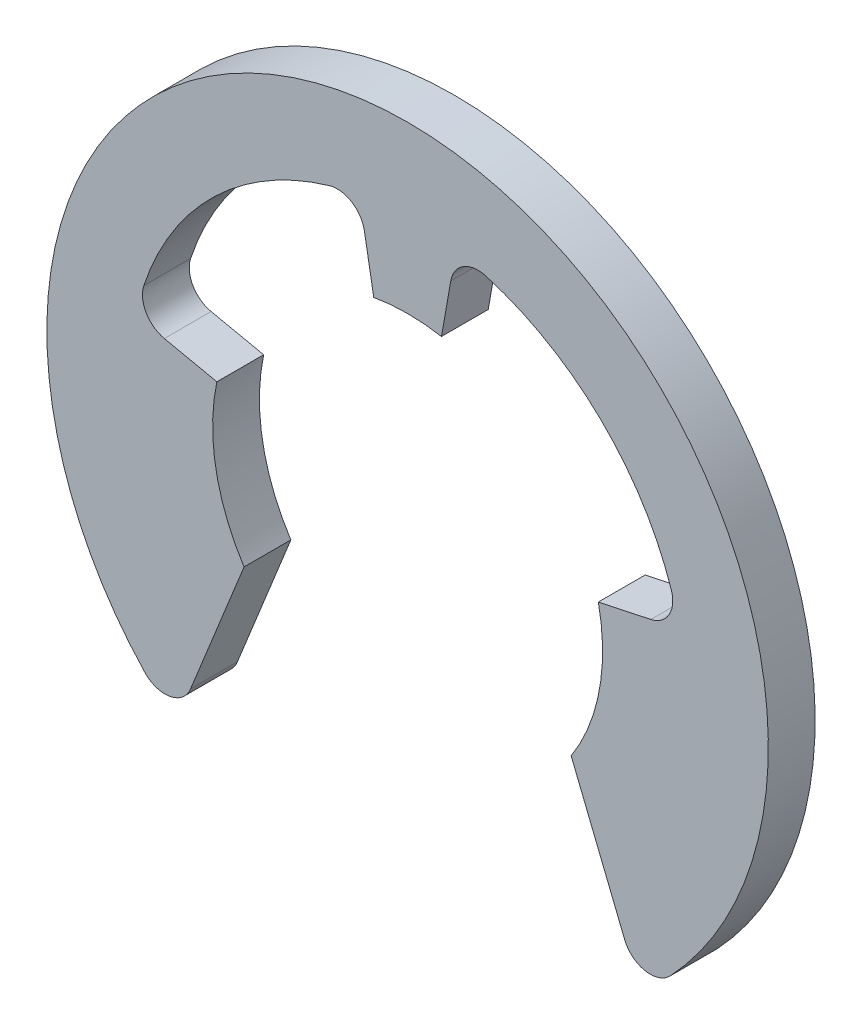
ISO-10303-21;
HEADER;
FILE_DESCRIPTION(('STEP AP214'),'2;1');
FILE_NAME('part.step','',(''),(''),'','','');
FILE_SCHEMA(('AUTOMOTIVE_DESIGN { 1 0 10303 214 1 1 1 1 }'));
ENDSEC;
DATA;
#1=APPLICATION_CONTEXT('core data for automotive mechanical design processes');
#2=APPLICATION_PROTOCOL_DEFINITION('international standard','automotive_design',2000,#1);
#3=PRODUCT_CONTEXT('',#1,'mechanical');
#4=PRODUCT('Part','Part','',(#3));
#5=PRODUCT_RELATED_PRODUCT_CATEGORY('part','',(#4));
#6=PRODUCT_DEFINITION_FORMATION('','',#4);
#7=PRODUCT_DEFINITION_CONTEXT('part definition',#1,'design');
#8=PRODUCT_DEFINITION('design','',#6,#7);
#9=PRODUCT_DEFINITION_SHAPE('','',#8);
#10=(LENGTH_UNIT() NAMED_UNIT(*) SI_UNIT(.MILLI.,.METRE.));
#11=(NAMED_UNIT(*) PLANE_ANGLE_UNIT() SI_UNIT($,.RADIAN.));
#12=(NAMED_UNIT(*) SI_UNIT($,.STERADIAN.) SOLID_ANGLE_UNIT());
#13=UNCERTAINTY_MEASURE_WITH_UNIT(LENGTH_MEASURE(1.E-05),#10,'distance_accuracy_value','');
#14=(GEOMETRIC_REPRESENTATION_CONTEXT(3) GLOBAL_UNCERTAINTY_ASSIGNED_CONTEXT((#13)) GLOBAL_UNIT_ASSIGNED_CONTEXT((#10,
#11,#12)) REPRESENTATION_CONTEXT('',''));
#15=CARTESIAN_POINT('',(0.,0.,0.));
#16=DIRECTION('',(0.,0.,1.));
#17=DIRECTION('',(1.,0.,0.));
#18=AXIS2_PLACEMENT_3D('',#15,#16,#17);
#19=CARTESIAN_POINT('',(-1.94289029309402E-13,0.,1.2));
#20=DIRECTION('',(0.,0.,-1.));
#21=DIRECTION('',(-1.,0.,0.));
#22=AXIS2_PLACEMENT_3D('',#19,#20,#21);
#23=CYLINDRICAL_SURFACE('',#22,9.25);
#24=CARTESIAN_POINT('',(0.,0.,0.));
#25=DIRECTION('',(0.,0.,1.));
#26=DIRECTION('',(1.,0.,0.));
#27=AXIS2_PLACEMENT_3D('',#24,#25,#26);
#28=CIRCLE('',#27,9.25);
#29=CARTESIAN_POINT('',(6.73756513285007,-6.33780057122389,0.));
#30=VERTEX_POINT('',#29);
#31=CARTESIAN_POINT('',(-6.73756513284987,-6.33780057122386,0.));
#32=VERTEX_POINT('',#31);
#33=EDGE_CURVE('E162',#30,#32,#28,.T.);
#34=ORIENTED_EDGE('',*,*,#33,.T.);
#35=DIRECTION('',(0.,0.,-1.));
#36=VECTOR('',#35,1.);
#37=CARTESIAN_POINT('',(-6.73756513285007,-6.33780057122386,1.2));
#38=LINE('',#37,#36);
#39=CARTESIAN_POINT('',(-6.73756513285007,-6.33780057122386,1.2));
#40=VERTEX_POINT('',#39);
#41=EDGE_CURVE('E11',#40,#32,#38,.T.);
#42=ORIENTED_EDGE('',*,*,#41,.F.);
#43=CARTESIAN_POINT('',(-1.94289029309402E-13,0.,1.2));
#44=DIRECTION('',(0.,0.,1.));
#45=DIRECTION('',(1.,0.,0.));
#46=AXIS2_PLACEMENT_3D('',#43,#44,#45);
#47=CIRCLE('',#46,9.25);
#48=CARTESIAN_POINT('',(6.73756513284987,-6.33780057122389,1.2));
#49=VERTEX_POINT('',#48);
#50=EDGE_CURVE('E163',#49,#40,#47,.T.);
#51=ORIENTED_EDGE('',*,*,#50,.F.);
#52=DIRECTION('',(0.,0.,-1.));
#53=VECTOR('',#52,1.);
#54=CARTESIAN_POINT('',(6.73756513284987,-6.33780057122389,1.2));
#55=LINE('',#54,#53);
#56=EDGE_CURVE('E158',#49,#30,#55,.T.);
#57=ORIENTED_EDGE('',*,*,#56,.T.);
#58=EDGE_LOOP('',(#34,#42,#51,#57));
#59=FACE_BOUND('',#58,.T.);
#60=ADVANCED_FACE('F16',(#59),#23,.T.);
#61=CARTESIAN_POINT('',(-6.22162546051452,-5.85247350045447,1.2));
#62=DIRECTION('',(0.,0.,-1.));
#63=DIRECTION('',(-1.,0.,0.));
#64=AXIS2_PLACEMENT_3D('',#61,#62,#63);
#65=CYLINDRICAL_SURFACE('',#64,0.708333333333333);
#66=CARTESIAN_POINT('',(-6.22162546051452,-5.85247350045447,0.));
#67=DIRECTION('',(0.,0.,1.));
#68=DIRECTION('',(1.,0.,0.));
#69=AXIS2_PLACEMENT_3D('',#66,#67,#68);
#70=CIRCLE('',#69,0.708333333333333);
#71=CARTESIAN_POINT('',(-5.5648702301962,-6.11781983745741,0.));
#72=VERTEX_POINT('',#71);
#73=EDGE_CURVE('E207',#32,#72,#70,.T.);
#74=ORIENTED_EDGE('',*,*,#73,.T.);
#75=DIRECTION('',(0.,0.,-1.));
#76=VECTOR('',#75,1.);
#77=CARTESIAN_POINT('',(-5.56487023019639,-6.11781983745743,1.2));
#78=LINE('',#77,#76);
#79=CARTESIAN_POINT('',(-5.56487023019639,-6.11781983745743,1.2));
#80=VERTEX_POINT('',#79);
#81=EDGE_CURVE('E24',#80,#72,#78,.T.);
#82=ORIENTED_EDGE('',*,*,#81,.F.);
#83=CARTESIAN_POINT('',(-6.22162546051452,-5.85247350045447,1.2));
#84=DIRECTION('',(0.,0.,1.));
#85=DIRECTION('',(1.,0.,0.));
#86=AXIS2_PLACEMENT_3D('',#83,#84,#85);
#87=CIRCLE('',#86,0.708333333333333);
#88=EDGE_CURVE('E31',#40,#80,#87,.T.);
#89=ORIENTED_EDGE('',*,*,#88,.F.);
#90=ORIENTED_EDGE('',*,*,#41,.T.);
#91=EDGE_LOOP('',(#74,#82,#89,#90));
#92=FACE_BOUND('',#91,.T.);
#93=ADVANCED_FACE('F342',(#92),#65,.T.);
#94=CARTESIAN_POINT('',(-4.19335283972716,-2.72319517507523,1.19999999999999));
#95=DIRECTION('',(0.927183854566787,-0.374606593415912,0.));
#96=DIRECTION('',(0.374606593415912,0.927183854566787,0.));
#97=AXIS2_PLACEMENT_3D('',#94,#95,#96);
#98=PLANE('',#97);
#99=DIRECTION('',(-0.374606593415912,-0.927183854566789,0.));
#100=VECTOR('',#99,1.);
#101=CARTESIAN_POINT('',(-4.19335283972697,-2.7231951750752,0.));
#102=LINE('',#101,#100);
#103=CARTESIAN_POINT('',(-4.19335283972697,-2.7231951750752,0.));
#104=VERTEX_POINT('',#103);
#105=EDGE_CURVE('E204',#104,#72,#102,.T.);
#106=ORIENTED_EDGE('',*,*,#105,.F.);
#107=DIRECTION('',(0.,0.,-1.));
#108=VECTOR('',#107,1.);
#109=CARTESIAN_POINT('',(-4.19335283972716,-2.72319517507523,1.19999999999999));
#110=LINE('',#109,#108);
#111=CARTESIAN_POINT('',(-4.19335283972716,-2.72319517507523,1.19999999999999));
#112=VERTEX_POINT('',#111);
#113=EDGE_CURVE('E256',#112,#104,#110,.T.);
#114=ORIENTED_EDGE('',*,*,#113,.F.);
#115=DIRECTION('',(-0.374606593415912,-0.927183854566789,0.));
#116=VECTOR('',#115,1.);
#117=CARTESIAN_POINT('',(-4.19335283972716,-2.72319517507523,1.19999999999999));
#118=LINE('',#117,#116);
#119=EDGE_CURVE('E251',#112,#80,#118,.T.);
#120=ORIENTED_EDGE('',*,*,#119,.T.);
#121=ORIENTED_EDGE('',*,*,#81,.T.);
#122=EDGE_LOOP('',(#106,#114,#120,#121));
#123=FACE_BOUND('',#122,.T.);
#124=ADVANCED_FACE('F341',(#123),#98,.T.);
#125=CARTESIAN_POINT('',(-1.94289029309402E-13,0.,1.2));
#126=DIRECTION('',(0.,0.,-1.));
#127=DIRECTION('',(-1.,0.,0.));
#128=AXIS2_PLACEMENT_3D('',#125,#126,#127);
#129=CYLINDRICAL_SURFACE('',#128,5.);
#130=CARTESIAN_POINT('',(0.,0.,0.));
#131=DIRECTION('',(0.,0.,1.));
#132=DIRECTION('',(1.,0.,0.));
#133=AXIS2_PLACEMENT_3D('',#130,#131,#132);
#134=CIRCLE('',#133,5.);
#135=CARTESIAN_POINT('',(-4.89073800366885,1.03955845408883,0.));
#136=VERTEX_POINT('',#135);
#137=EDGE_CURVE('E201',#136,#104,#134,.T.);
#138=ORIENTED_EDGE('',*,*,#137,.F.);
#139=DIRECTION('',(0.,0.,-1.));
#140=VECTOR('',#139,1.);
#141=CARTESIAN_POINT('',(-4.89073800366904,1.03955845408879,1.2));
#142=LINE('',#141,#140);
#143=CARTESIAN_POINT('',(-4.89073800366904,1.03955845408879,1.2));
#144=VERTEX_POINT('',#143);
#145=EDGE_CURVE('E258',#144,#136,#142,.T.);
#146=ORIENTED_EDGE('',*,*,#145,.F.);
#147=CARTESIAN_POINT('',(-1.94289029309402E-13,0.,1.2));
#148=DIRECTION('',(0.,0.,1.));
#149=DIRECTION('',(1.,0.,0.));
#150=AXIS2_PLACEMENT_3D('',#147,#148,#149);
#151=CIRCLE('',#150,5.);
#152=EDGE_CURVE('E248',#144,#112,#151,.T.);
#153=ORIENTED_EDGE('',*,*,#152,.T.);
#154=ORIENTED_EDGE('',*,*,#113,.T.);
#155=EDGE_LOOP('',(#138,#146,#153,#154));
#156=FACE_BOUND('',#155,.T.);
#157=ADVANCED_FACE('F338',(#156),#129,.F.);
#158=CARTESIAN_POINT('',(-4.89073800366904,1.03955845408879,1.2));
#159=DIRECTION('',(-0.207911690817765,-0.978147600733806,0.));
#160=DIRECTION('',(0.978147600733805,-0.207911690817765,0.));
#161=AXIS2_PLACEMENT_3D('',#158,#159,#160);
#162=PLANE('',#161);
#163=DIRECTION('',(-0.978147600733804,0.207911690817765,0.));
#164=VECTOR('',#163,1.);
#165=CARTESIAN_POINT('',(-4.89073800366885,1.03955845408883,0.));
#166=LINE('',#165,#164);
#167=CARTESIAN_POINT('',(-6.23808791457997,1.32594651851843,0.));
#168=VERTEX_POINT('',#167);
#169=EDGE_CURVE('E198',#136,#168,#166,.T.);
#170=ORIENTED_EDGE('',*,*,#169,.T.);
#171=DIRECTION('',(0.,0.,-1.));
#172=VECTOR('',#171,1.);
#173=CARTESIAN_POINT('',(-6.23808791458,1.32594651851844,1.2));
#174=LINE('',#173,#172);
#175=CARTESIAN_POINT('',(-6.23808791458,1.32594651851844,1.2));
#176=VERTEX_POINT('',#175);
#177=EDGE_CURVE('E260',#176,#168,#174,.T.);
#178=ORIENTED_EDGE('',*,*,#177,.F.);
#179=DIRECTION('',(-0.978147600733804,0.207911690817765,0.));
#180=VECTOR('',#179,1.);
#181=CARTESIAN_POINT('',(-4.89073800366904,1.03955845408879,1.2));
#182=LINE('',#181,#180);
#183=EDGE_CURVE('E246',#144,#176,#182,.T.);
#184=ORIENTED_EDGE('',*,*,#183,.F.);
#185=ORIENTED_EDGE('',*,*,#145,.T.);
#186=EDGE_LOOP('',(#170,#178,#184,#185));
#187=FACE_BOUND('',#186,.T.);
#188=ADVANCED_FACE('F335',(#187),#162,.F.);
#189=CARTESIAN_POINT('',(-6.09081713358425,2.0188010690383,1.2));
#190=DIRECTION('',(0.,0.,-1.));
#191=DIRECTION('',(-1.,0.,0.));
#192=AXIS2_PLACEMENT_3D('',#189,#190,#191);
#193=CYLINDRICAL_SURFACE('',#192,0.708333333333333);
#194=CARTESIAN_POINT('',(-6.09081713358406,2.01880106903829,0.));
#195=DIRECTION('',(0.,0.,1.));
#196=DIRECTION('',(1.,0.,0.));
#197=AXIS2_PLACEMENT_3D('',#194,#195,#196);
#198=CIRCLE('',#197,0.708333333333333);
#199=CARTESIAN_POINT('',(-6.76318006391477,2.24165573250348,0.));
#200=VERTEX_POINT('',#199);
#201=EDGE_CURVE('E195',#200,#168,#198,.T.);
#202=ORIENTED_EDGE('',*,*,#201,.F.);
#203=DIRECTION('',(0.,0.,-1.));
#204=VECTOR('',#203,1.);
#205=CARTESIAN_POINT('',(-6.76318006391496,2.24165573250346,1.2));
#206=LINE('',#205,#204);
#207=CARTESIAN_POINT('',(-6.76318006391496,2.24165573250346,1.2));
#208=VERTEX_POINT('',#207);
#209=EDGE_CURVE('E262',#208,#200,#206,.T.);
#210=ORIENTED_EDGE('',*,*,#209,.F.);
#211=CARTESIAN_POINT('',(-6.09081713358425,2.0188010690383,1.2));
#212=DIRECTION('',(0.,0.,1.));
#213=DIRECTION('',(1.,0.,0.));
#214=AXIS2_PLACEMENT_3D('',#211,#212,#213);
#215=CIRCLE('',#214,0.708333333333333);
#216=EDGE_CURVE('E243',#208,#176,#215,.T.);
#217=ORIENTED_EDGE('',*,*,#216,.T.);
#218=ORIENTED_EDGE('',*,*,#177,.T.);
#219=EDGE_LOOP('',(#202,#210,#217,#218));
#220=FACE_BOUND('',#219,.T.);
#221=ADVANCED_FACE('F330',(#220),#193,.F.);
#222=CARTESIAN_POINT('',(-1.94289029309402E-13,0.,1.2));
#223=DIRECTION('',(0.,0.,-1.));
#224=DIRECTION('',(-1.,0.,0.));
#225=AXIS2_PLACEMENT_3D('',#222,#223,#224);
#226=CYLINDRICAL_SURFACE('',#225,7.125);
#227=CARTESIAN_POINT('',(0.,0.,0.));
#228=DIRECTION('',(0.,0.,1.));
#229=DIRECTION('',(1.,0.,0.));
#230=AXIS2_PLACEMENT_3D('',#227,#228,#229);
#231=CIRCLE('',#230,7.125);
#232=CARTESIAN_POINT('',(-2.00425859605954,6.83729277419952,0.));
#233=VERTEX_POINT('',#232);
#234=EDGE_CURVE('E192',#233,#200,#231,.T.);
#235=ORIENTED_EDGE('',*,*,#234,.F.);
#236=DIRECTION('',(0.,0.,-1.));
#237=VECTOR('',#236,1.);
#238=CARTESIAN_POINT('',(-2.00425859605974,6.83729277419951,1.2));
#239=LINE('',#238,#237);
#240=CARTESIAN_POINT('',(-2.00425859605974,6.83729277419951,1.2));
#241=VERTEX_POINT('',#240);
#242=EDGE_CURVE('E264',#241,#233,#239,.T.);
#243=ORIENTED_EDGE('',*,*,#242,.F.);
#244=CARTESIAN_POINT('',(-1.94289029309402E-13,0.,1.2));
#245=DIRECTION('',(0.,0.,1.));
#246=DIRECTION('',(1.,0.,0.));
#247=AXIS2_PLACEMENT_3D('',#244,#245,#246);
#248=CIRCLE('',#247,7.125);
#249=EDGE_CURVE('E240',#241,#208,#248,.T.);
#250=ORIENTED_EDGE('',*,*,#249,.T.);
#251=ORIENTED_EDGE('',*,*,#209,.T.);
#252=EDGE_LOOP('',(#235,#243,#250,#251));
#253=FACE_BOUND('',#252,.T.);
#254=ADVANCED_FACE('F325',(#253),#226,.F.);
#255=CARTESIAN_POINT('',(-1.80500481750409,6.15756191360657,1.19999999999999));
#256=DIRECTION('',(0.,0.,-1.));
#257=DIRECTION('',(-1.,0.,0.));
#258=AXIS2_PLACEMENT_3D('',#255,#256,#257);
#259=CYLINDRICAL_SURFACE('',#258,0.708333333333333);
#260=CARTESIAN_POINT('',(-1.8050048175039,6.15756191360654,0.));
#261=DIRECTION('',(0.,0.,1.));
#262=DIRECTION('',(1.,0.,0.));
#263=AXIS2_PLACEMENT_3D('',#260,#261,#262);
#264=CIRCLE('',#263,0.708333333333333);
#265=CARTESIAN_POINT('',(-1.10743265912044,6.28056270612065,0.));
#266=VERTEX_POINT('',#265);
#267=EDGE_CURVE('E189',#266,#233,#264,.T.);
#268=ORIENTED_EDGE('',*,*,#267,.F.);
#269=DIRECTION('',(0.,0.,-1.));
#270=VECTOR('',#269,1.);
#271=CARTESIAN_POINT('',(-1.10743265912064,6.28056270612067,1.2));
#272=LINE('',#271,#270);
#273=CARTESIAN_POINT('',(-1.10743265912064,6.28056270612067,1.2));
#274=VERTEX_POINT('',#273);
#275=EDGE_CURVE('E266',#274,#266,#272,.T.);
#276=ORIENTED_EDGE('',*,*,#275,.F.);
#277=CARTESIAN_POINT('',(-1.80500481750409,6.15756191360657,1.19999999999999));
#278=DIRECTION('',(0.,0.,1.));
#279=DIRECTION('',(1.,0.,0.));
#280=AXIS2_PLACEMENT_3D('',#277,#278,#279);
#281=CIRCLE('',#280,0.708333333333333);
#282=EDGE_CURVE('E237',#274,#241,#281,.T.);
#283=ORIENTED_EDGE('',*,*,#282,.T.);
#284=ORIENTED_EDGE('',*,*,#242,.T.);
#285=EDGE_LOOP('',(#268,#276,#283,#284));
#286=FACE_BOUND('',#285,.T.);
#287=ADVANCED_FACE('F321',(#286),#259,.F.);
#288=CARTESIAN_POINT('',(-0.868240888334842,4.92403876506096,1.2));
#289=DIRECTION('',(-0.984807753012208,-0.173648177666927,0.));
#290=DIRECTION('',(0.173648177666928,-0.98480775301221,0.));
#291=AXIS2_PLACEMENT_3D('',#288,#289,#290);
#292=PLANE('',#291);
#293=DIRECTION('',(-0.173648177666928,0.98480775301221,0.));
#294=VECTOR('',#293,1.);
#295=CARTESIAN_POINT('',(-0.868240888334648,4.92403876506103,0.));
#296=LINE('',#295,#294);
#297=CARTESIAN_POINT('',(-0.868240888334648,4.92403876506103,0.));
#298=VERTEX_POINT('',#297);
#299=EDGE_CURVE('E186',#298,#266,#296,.T.);
#300=ORIENTED_EDGE('',*,*,#299,.F.);
#301=DIRECTION('',(0.,0.,-1.));
#302=VECTOR('',#301,1.);
#303=CARTESIAN_POINT('',(-0.868240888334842,4.92403876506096,1.2));
#304=LINE('',#303,#302);
#305=CARTESIAN_POINT('',(-0.868240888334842,4.92403876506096,1.2));
#306=VERTEX_POINT('',#305);
#307=EDGE_CURVE('E268',#306,#298,#304,.T.);
#308=ORIENTED_EDGE('',*,*,#307,.F.);
#309=DIRECTION('',(-0.173648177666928,0.98480775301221,0.));
#310=VECTOR('',#309,1.);
#311=CARTESIAN_POINT('',(-0.868240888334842,4.92403876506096,1.2));
#312=LINE('',#311,#310);
#313=EDGE_CURVE('E234',#306,#274,#312,.T.);
#314=ORIENTED_EDGE('',*,*,#313,.T.);
#315=ORIENTED_EDGE('',*,*,#275,.T.);
#316=EDGE_LOOP('',(#300,#308,#314,#315));
#317=FACE_BOUND('',#316,.T.);
#318=ADVANCED_FACE('F317',(#317),#292,.T.);
#319=CARTESIAN_POINT('',(-1.94289029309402E-13,0.,1.2));
#320=DIRECTION('',(0.,0.,-1.));
#321=DIRECTION('',(-1.,0.,0.));
#322=AXIS2_PLACEMENT_3D('',#319,#320,#321);
#323=CYLINDRICAL_SURFACE('',#322,5.);
#324=CARTESIAN_POINT('',(0.,0.,0.));
#325=DIRECTION('',(0.,0.,1.));
#326=DIRECTION('',(1.,0.,0.));
#327=AXIS2_PLACEMENT_3D('',#324,#325,#326);
#328=CIRCLE('',#327,5.);
#329=CARTESIAN_POINT('',(0.868240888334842,4.92403876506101,0.));
#330=VERTEX_POINT('',#329);
#331=EDGE_CURVE('E183',#330,#298,#328,.T.);
#332=ORIENTED_EDGE('',*,*,#331,.F.);
#333=DIRECTION('',(0.,0.,-1.));
#334=VECTOR('',#333,1.);
#335=CARTESIAN_POINT('',(0.868240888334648,4.92403876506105,1.20000000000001));
#336=LINE('',#335,#334);
#337=CARTESIAN_POINT('',(0.868240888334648,4.92403876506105,1.20000000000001));
#338=VERTEX_POINT('',#337);
#339=EDGE_CURVE('E270',#338,#330,#336,.T.);
#340=ORIENTED_EDGE('',*,*,#339,.F.);
#341=CARTESIAN_POINT('',(-1.94289029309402E-13,0.,1.2));
#342=DIRECTION('',(0.,0.,1.));
#343=DIRECTION('',(1.,0.,0.));
#344=AXIS2_PLACEMENT_3D('',#341,#342,#343);
#345=CIRCLE('',#344,5.);
#346=EDGE_CURVE('E231',#338,#306,#345,.T.);
#347=ORIENTED_EDGE('',*,*,#346,.T.);
#348=ORIENTED_EDGE('',*,*,#307,.T.);
#349=EDGE_LOOP('',(#332,#340,#347,#348));
#350=FACE_BOUND('',#349,.T.);
#351=ADVANCED_FACE('F313',(#350),#323,.F.);
#352=CARTESIAN_POINT('',(0.868240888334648,4.92403876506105,1.20000000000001));
#353=DIRECTION('',(-0.984807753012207,0.173648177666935,0.));
#354=DIRECTION('',(-0.173648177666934,-0.984807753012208,0.));
#355=AXIS2_PLACEMENT_3D('',#352,#353,#354);
#356=PLANE('',#355);
#357=DIRECTION('',(0.173648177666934,0.984807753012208,0.));
#358=VECTOR('',#357,1.);
#359=CARTESIAN_POINT('',(0.868240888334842,4.92403876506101,0.));
#360=LINE('',#359,#358);
#361=CARTESIAN_POINT('',(1.10743265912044,6.28056270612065,0.));
#362=VERTEX_POINT('',#361);
#363=EDGE_CURVE('E180',#330,#362,#360,.T.);
#364=ORIENTED_EDGE('',*,*,#363,.T.);
#365=DIRECTION('',(0.,0.,-1.));
#366=VECTOR('',#365,1.);
#367=CARTESIAN_POINT('',(1.10743265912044,6.28056270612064,1.2));
#368=LINE('',#367,#366);
#369=CARTESIAN_POINT('',(1.10743265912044,6.28056270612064,1.2));
#370=VERTEX_POINT('',#369);
#371=EDGE_CURVE('E272',#370,#362,#368,.T.);
#372=ORIENTED_EDGE('',*,*,#371,.F.);
#373=DIRECTION('',(0.173648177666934,0.984807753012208,0.));
#374=VECTOR('',#373,1.);
#375=CARTESIAN_POINT('',(0.868240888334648,4.92403876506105,1.20000000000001));
#376=LINE('',#375,#374);
#377=EDGE_CURVE('E229',#338,#370,#376,.T.);
#378=ORIENTED_EDGE('',*,*,#377,.F.);
#379=ORIENTED_EDGE('',*,*,#339,.T.);
#380=EDGE_LOOP('',(#364,#372,#378,#379));
#381=FACE_BOUND('',#380,.T.);
#382=ADVANCED_FACE('F310',(#381),#356,.F.);
#383=CARTESIAN_POINT('',(1.8050048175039,6.15756191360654,1.2));
#384=DIRECTION('',(0.,0.,-1.));
#385=DIRECTION('',(-1.,0.,0.));
#386=AXIS2_PLACEMENT_3D('',#383,#384,#385);
#387=CYLINDRICAL_SURFACE('',#386,0.708333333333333);
#388=CARTESIAN_POINT('',(1.80500481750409,6.15756191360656,0.));
#389=DIRECTION('',(0.,0.,1.));
#390=DIRECTION('',(1.,0.,0.));
#391=AXIS2_PLACEMENT_3D('',#388,#389,#390);
#392=CIRCLE('',#391,0.708333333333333);
#393=CARTESIAN_POINT('',(2.00425859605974,6.83729277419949,0.));
#394=VERTEX_POINT('',#393);
#395=EDGE_CURVE('E177',#394,#362,#392,.T.);
#396=ORIENTED_EDGE('',*,*,#395,.F.);
#397=DIRECTION('',(0.,0.,-1.));
#398=VECTOR('',#397,1.);
#399=CARTESIAN_POINT('',(2.00425859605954,6.83729277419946,1.2));
#400=LINE('',#399,#398);
#401=CARTESIAN_POINT('',(2.00425859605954,6.83729277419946,1.2));
#402=VERTEX_POINT('',#401);
#403=EDGE_CURVE('E274',#402,#394,#400,.T.);
#404=ORIENTED_EDGE('',*,*,#403,.F.);
#405=CARTESIAN_POINT('',(1.8050048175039,6.15756191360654,1.2));
#406=DIRECTION('',(0.,0.,1.));
#407=DIRECTION('',(1.,0.,0.));
#408=AXIS2_PLACEMENT_3D('',#405,#406,#407);
#409=CIRCLE('',#408,0.708333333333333);
#410=EDGE_CURVE('E226',#402,#370,#409,.T.);
#411=ORIENTED_EDGE('',*,*,#410,.T.);
#412=ORIENTED_EDGE('',*,*,#371,.T.);
#413=EDGE_LOOP('',(#396,#404,#411,#412));
#414=FACE_BOUND('',#413,.T.);
#415=ADVANCED_FACE('F305',(#414),#387,.F.);
#416=CARTESIAN_POINT('',(-1.94289029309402E-13,0.,1.2));
#417=DIRECTION('',(0.,0.,-1.));
#418=DIRECTION('',(-1.,0.,0.));
#419=AXIS2_PLACEMENT_3D('',#416,#417,#418);
#420=CYLINDRICAL_SURFACE('',#419,7.125);
#421=CARTESIAN_POINT('',(0.,0.,0.));
#422=DIRECTION('',(0.,0.,1.));
#423=DIRECTION('',(1.,0.,0.));
#424=AXIS2_PLACEMENT_3D('',#421,#422,#423);
#425=CIRCLE('',#424,7.125);
#426=CARTESIAN_POINT('',(6.76318006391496,2.24165573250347,0.));
#427=VERTEX_POINT('',#426);
#428=EDGE_CURVE('E174',#427,#394,#425,.T.);
#429=ORIENTED_EDGE('',*,*,#428,.F.);
#430=DIRECTION('',(0.,0.,-1.));
#431=VECTOR('',#430,1.);
#432=CARTESIAN_POINT('',(6.7631800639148,2.24165573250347,1.2));
#433=LINE('',#432,#431);
#434=CARTESIAN_POINT('',(6.7631800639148,2.24165573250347,1.2));
#435=VERTEX_POINT('',#434);
#436=EDGE_CURVE('E276',#435,#427,#433,.T.);
#437=ORIENTED_EDGE('',*,*,#436,.F.);
#438=CARTESIAN_POINT('',(-1.94289029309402E-13,0.,1.2));
#439=DIRECTION('',(0.,0.,1.));
#440=DIRECTION('',(1.,0.,0.));
#441=AXIS2_PLACEMENT_3D('',#438,#439,#440);
#442=CIRCLE('',#441,7.125);
#443=EDGE_CURVE('E223',#435,#402,#442,.T.);
#444=ORIENTED_EDGE('',*,*,#443,.T.);
#445=ORIENTED_EDGE('',*,*,#403,.T.);
#446=EDGE_LOOP('',(#429,#437,#444,#445));
#447=FACE_BOUND('',#446,.T.);
#448=ADVANCED_FACE('F300',(#447),#420,.F.);
#449=CARTESIAN_POINT('',(6.09081713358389,2.01880106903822,1.2));
#450=DIRECTION('',(0.,0.,-1.));
#451=DIRECTION('',(-1.,0.,0.));
#452=AXIS2_PLACEMENT_3D('',#449,#450,#451);
#453=CYLINDRICAL_SURFACE('',#452,0.708333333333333);
#454=CARTESIAN_POINT('',(6.09081713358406,2.01880106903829,0.));
#455=DIRECTION('',(0.,0.,1.));
#456=DIRECTION('',(1.,0.,0.));
#457=AXIS2_PLACEMENT_3D('',#454,#455,#456);
#458=CIRCLE('',#457,0.708333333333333);
#459=CARTESIAN_POINT('',(6.23808791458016,1.3259465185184,0.));
#460=VERTEX_POINT('',#459);
#461=EDGE_CURVE('E171',#460,#427,#458,.T.);
#462=ORIENTED_EDGE('',*,*,#461,.F.);
#463=DIRECTION('',(0.,0.,-1.));
#464=VECTOR('',#463,1.);
#465=CARTESIAN_POINT('',(6.23808791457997,1.32594651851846,1.2));
#466=LINE('',#465,#464);
#467=CARTESIAN_POINT('',(6.23808791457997,1.32594651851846,1.2));
#468=VERTEX_POINT('',#467);
#469=EDGE_CURVE('E278',#468,#460,#466,.T.);
#470=ORIENTED_EDGE('',*,*,#469,.F.);
#471=CARTESIAN_POINT('',(6.09081713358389,2.01880106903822,1.2));
#472=DIRECTION('',(0.,0.,1.));
#473=DIRECTION('',(1.,0.,0.));
#474=AXIS2_PLACEMENT_3D('',#471,#472,#473);
#475=CIRCLE('',#474,0.708333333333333);
#476=EDGE_CURVE('E220',#468,#435,#475,.T.);
#477=ORIENTED_EDGE('',*,*,#476,.T.);
#478=ORIENTED_EDGE('',*,*,#436,.T.);
#479=EDGE_LOOP('',(#462,#470,#477,#478));
#480=FACE_BOUND('',#479,.T.);
#481=ADVANCED_FACE('F296',(#480),#453,.F.);
#482=CARTESIAN_POINT('',(4.89073800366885,1.03955845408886,1.2));
#483=DIRECTION('',(-0.207911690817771,0.978147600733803,0.));
#484=DIRECTION('',(-0.978147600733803,-0.207911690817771,0.));
#485=AXIS2_PLACEMENT_3D('',#482,#483,#484);
#486=PLANE('',#485);
#487=DIRECTION('',(0.978147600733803,0.207911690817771,0.));
#488=VECTOR('',#487,1.);
#489=CARTESIAN_POINT('',(4.89073800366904,1.03955845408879,0.));
#490=LINE('',#489,#488);
#491=CARTESIAN_POINT('',(4.89073800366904,1.03955845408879,0.));
#492=VERTEX_POINT('',#491);
#493=EDGE_CURVE('E168',#492,#460,#490,.T.);
#494=ORIENTED_EDGE('',*,*,#493,.F.);
#495=DIRECTION('',(0.,0.,-1.));
#496=VECTOR('',#495,1.);
#497=CARTESIAN_POINT('',(4.89073800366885,1.03955845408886,1.2));
#498=LINE('',#497,#496);
#499=CARTESIAN_POINT('',(4.89073800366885,1.03955845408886,1.2));
#500=VERTEX_POINT('',#499);
#501=EDGE_CURVE('E280',#500,#492,#498,.T.);
#502=ORIENTED_EDGE('',*,*,#501,.F.);
#503=DIRECTION('',(0.978147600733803,0.207911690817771,0.));
#504=VECTOR('',#503,1.);
#505=CARTESIAN_POINT('',(4.89073800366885,1.03955845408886,1.2));
#506=LINE('',#505,#504);
#507=EDGE_CURVE('E217',#500,#468,#506,.T.);
#508=ORIENTED_EDGE('',*,*,#507,.T.);
#509=ORIENTED_EDGE('',*,*,#469,.T.);
#510=EDGE_LOOP('',(#494,#502,#508,#509));
#511=FACE_BOUND('',#510,.T.);
#512=ADVANCED_FACE('F294',(#511),#486,.T.);
#513=CARTESIAN_POINT('',(-1.94289029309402E-13,0.,1.2));
#514=DIRECTION('',(0.,0.,-1.));
#515=DIRECTION('',(-1.,0.,0.));
#516=AXIS2_PLACEMENT_3D('',#513,#514,#515);
#517=CYLINDRICAL_SURFACE('',#516,5.);
#518=CARTESIAN_POINT('',(0.,0.,0.));
#519=DIRECTION('',(0.,0.,1.));
#520=DIRECTION('',(1.,0.,0.));
#521=AXIS2_PLACEMENT_3D('',#518,#519,#520);
#522=CIRCLE('',#521,5.);
#523=CARTESIAN_POINT('',(4.19335283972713,-2.72319517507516,0.));
#524=VERTEX_POINT('',#523);
#525=EDGE_CURVE('E151',#524,#492,#522,.T.);
#526=ORIENTED_EDGE('',*,*,#525,.F.);
#527=DIRECTION('',(0.,0.,-1.));
#528=VECTOR('',#527,1.);
#529=CARTESIAN_POINT('',(4.19335283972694,-2.72319517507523,1.2));
#530=LINE('',#529,#528);
#531=CARTESIAN_POINT('',(4.19335283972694,-2.72319517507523,1.2));
#532=VERTEX_POINT('',#531);
#533=EDGE_CURVE('E145',#532,#524,#530,.T.);
#534=ORIENTED_EDGE('',*,*,#533,.F.);
#535=CARTESIAN_POINT('',(-1.94289029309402E-13,0.,1.2));
#536=DIRECTION('',(0.,0.,1.));
#537=DIRECTION('',(1.,0.,0.));
#538=AXIS2_PLACEMENT_3D('',#535,#536,#537);
#539=CIRCLE('',#538,5.);
#540=EDGE_CURVE('E214',#532,#500,#539,.T.);
#541=ORIENTED_EDGE('',*,*,#540,.T.);
#542=ORIENTED_EDGE('',*,*,#501,.T.);
#543=EDGE_LOOP('',(#526,#534,#541,#542));
#544=FACE_BOUND('',#543,.T.);
#545=ADVANCED_FACE('F290',(#544),#517,.F.);
#546=CARTESIAN_POINT('',(4.19335283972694,-2.72319517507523,1.2));
#547=DIRECTION('',(0.927183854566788,0.374606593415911,0.));
#548=DIRECTION('',(-0.374606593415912,0.927183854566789,0.));
#549=AXIS2_PLACEMENT_3D('',#546,#547,#548);
#550=PLANE('',#549);
#551=DIRECTION('',(0.374606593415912,-0.927183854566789,0.));
#552=VECTOR('',#551,1.);
#553=CARTESIAN_POINT('',(4.19335283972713,-2.72319517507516,0.));
#554=LINE('',#553,#552);
#555=CARTESIAN_POINT('',(5.56487023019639,-6.11781983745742,0.));
#556=VERTEX_POINT('',#555);
#557=EDGE_CURVE('E140',#524,#556,#554,.T.);
#558=ORIENTED_EDGE('',*,*,#557,.T.);
#559=DIRECTION('',(0.,0.,-1.));
#560=VECTOR('',#559,1.);
#561=CARTESIAN_POINT('',(5.56487023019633,-6.11781983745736,1.20000000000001));
#562=LINE('',#561,#560);
#563=CARTESIAN_POINT('',(5.56487023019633,-6.11781983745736,1.20000000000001));
#564=VERTEX_POINT('',#563);
#565=EDGE_CURVE('E19',#564,#556,#562,.T.);
#566=ORIENTED_EDGE('',*,*,#565,.F.);
#567=DIRECTION('',(0.374606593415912,-0.927183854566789,0.));
#568=VECTOR('',#567,1.);
#569=CARTESIAN_POINT('',(4.19335283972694,-2.72319517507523,1.2));
#570=LINE('',#569,#568);
#571=EDGE_CURVE('E212',#532,#564,#570,.T.);
#572=ORIENTED_EDGE('',*,*,#571,.F.);
#573=ORIENTED_EDGE('',*,*,#533,.T.);
#574=EDGE_LOOP('',(#558,#566,#572,#573));
#575=FACE_BOUND('',#574,.T.);
#576=ADVANCED_FACE('F142',(#575),#550,.F.);
#577=CARTESIAN_POINT('',(6.22162546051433,-5.85247350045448,1.2));
#578=DIRECTION('',(0.,0.,-1.));
#579=DIRECTION('',(-1.,0.,0.));
#580=AXIS2_PLACEMENT_3D('',#577,#578,#579);
#581=CYLINDRICAL_SURFACE('',#580,0.708333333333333);
#582=CARTESIAN_POINT('',(6.22162546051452,-5.85247350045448,0.));
#583=DIRECTION('',(0.,0.,1.));
#584=DIRECTION('',(1.,0.,0.));
#585=AXIS2_PLACEMENT_3D('',#582,#583,#584);
#586=CIRCLE('',#585,0.708333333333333);
#587=EDGE_CURVE('E150',#556,#30,#586,.T.);
#588=ORIENTED_EDGE('',*,*,#587,.T.);
#589=ORIENTED_EDGE('',*,*,#56,.F.);
#590=CARTESIAN_POINT('',(6.22162546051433,-5.85247350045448,1.2));
#591=DIRECTION('',(0.,0.,1.));
#592=DIRECTION('',(1.,0.,0.));
#593=AXIS2_PLACEMENT_3D('',#590,#591,#592);
#594=CIRCLE('',#593,0.708333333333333);
#595=EDGE_CURVE('E157',#564,#49,#594,.T.);
#596=ORIENTED_EDGE('',*,*,#595,.F.);
#597=ORIENTED_EDGE('',*,*,#565,.T.);
#598=EDGE_LOOP('',(#588,#589,#596,#597));
#599=FACE_BOUND('',#598,.T.);
#600=ADVANCED_FACE('F154',(#599),#581,.T.);
#601=CARTESIAN_POINT('',(-1.94289029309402E-13,0.,1.2));
#602=DIRECTION('',(0.,0.,1.));
#603=DIRECTION('',(1.,0.,0.));
#604=AXIS2_PLACEMENT_3D('',#601,#602,#603);
#605=PLANE('',#604);
#606=ORIENTED_EDGE('',*,*,#50,.T.);
#607=ORIENTED_EDGE('',*,*,#88,.T.);
#608=ORIENTED_EDGE('',*,*,#119,.F.);
#609=ORIENTED_EDGE('',*,*,#152,.F.);
#610=ORIENTED_EDGE('',*,*,#183,.T.);
#611=ORIENTED_EDGE('',*,*,#216,.F.);
#612=ORIENTED_EDGE('',*,*,#249,.F.);
#613=ORIENTED_EDGE('',*,*,#282,.F.);
#614=ORIENTED_EDGE('',*,*,#313,.F.);
#615=ORIENTED_EDGE('',*,*,#346,.F.);
#616=ORIENTED_EDGE('',*,*,#377,.T.);
#617=ORIENTED_EDGE('',*,*,#410,.F.);
#618=ORIENTED_EDGE('',*,*,#443,.F.);
#619=ORIENTED_EDGE('',*,*,#476,.F.);
#620=ORIENTED_EDGE('',*,*,#507,.F.);
#621=ORIENTED_EDGE('',*,*,#540,.F.);
#622=ORIENTED_EDGE('',*,*,#571,.T.);
#623=ORIENTED_EDGE('',*,*,#595,.T.);
#624=EDGE_LOOP('',(#606,#607,#608,#609,#610,#611,#612,#613,#614,#615,#616,#617,#618,#619,#620,
#621,#622,#623));
#625=FACE_BOUND('',#624,.T.);
#626=ADVANCED_FACE('F285',(#625),#605,.T.);
#627=CARTESIAN_POINT('',(0.,0.,0.));
#628=DIRECTION('',(0.,0.,1.));
#629=DIRECTION('',(1.,0.,0.));
#630=AXIS2_PLACEMENT_3D('',#627,#628,#629);
#631=PLANE('',#630);
#632=ORIENTED_EDGE('',*,*,#33,.F.);
#633=ORIENTED_EDGE('',*,*,#587,.F.);
#634=ORIENTED_EDGE('',*,*,#557,.F.);
#635=ORIENTED_EDGE('',*,*,#525,.T.);
#636=ORIENTED_EDGE('',*,*,#493,.T.);
#637=ORIENTED_EDGE('',*,*,#461,.T.);
#638=ORIENTED_EDGE('',*,*,#428,.T.);
#639=ORIENTED_EDGE('',*,*,#395,.T.);
#640=ORIENTED_EDGE('',*,*,#363,.F.);
#641=ORIENTED_EDGE('',*,*,#331,.T.);
#642=ORIENTED_EDGE('',*,*,#299,.T.);
#643=ORIENTED_EDGE('',*,*,#267,.T.);
#644=ORIENTED_EDGE('',*,*,#234,.T.);
#645=ORIENTED_EDGE('',*,*,#201,.T.);
#646=ORIENTED_EDGE('',*,*,#169,.F.);
#647=ORIENTED_EDGE('',*,*,#137,.T.);
#648=ORIENTED_EDGE('',*,*,#105,.T.);
#649=ORIENTED_EDGE('',*,*,#73,.F.);
#650=EDGE_LOOP('',(#632,#633,#634,#635,#636,#637,#638,#639,#640,#641,#642,#643,#644,#645,#646,
#647,#648,#649));
#651=FACE_BOUND('',#650,.T.);
#652=ADVANCED_FACE('F160',(#651),#631,.F.);
#653=CLOSED_SHELL('',(#60,#93,#124,#157,#188,#221,#254,#287,#318,#351,#382,#415,#448,#481,#512,
#545,#576,#600,#626,#652));
#654=MANIFOLD_SOLID_BREP('B1',#653);
#655=ADVANCED_BREP_SHAPE_REPRESENTATION('',(#18,#654),#14);
#656=SHAPE_DEFINITION_REPRESENTATION(#9,#655);
ENDSEC;
END-ISO-10303-21;
